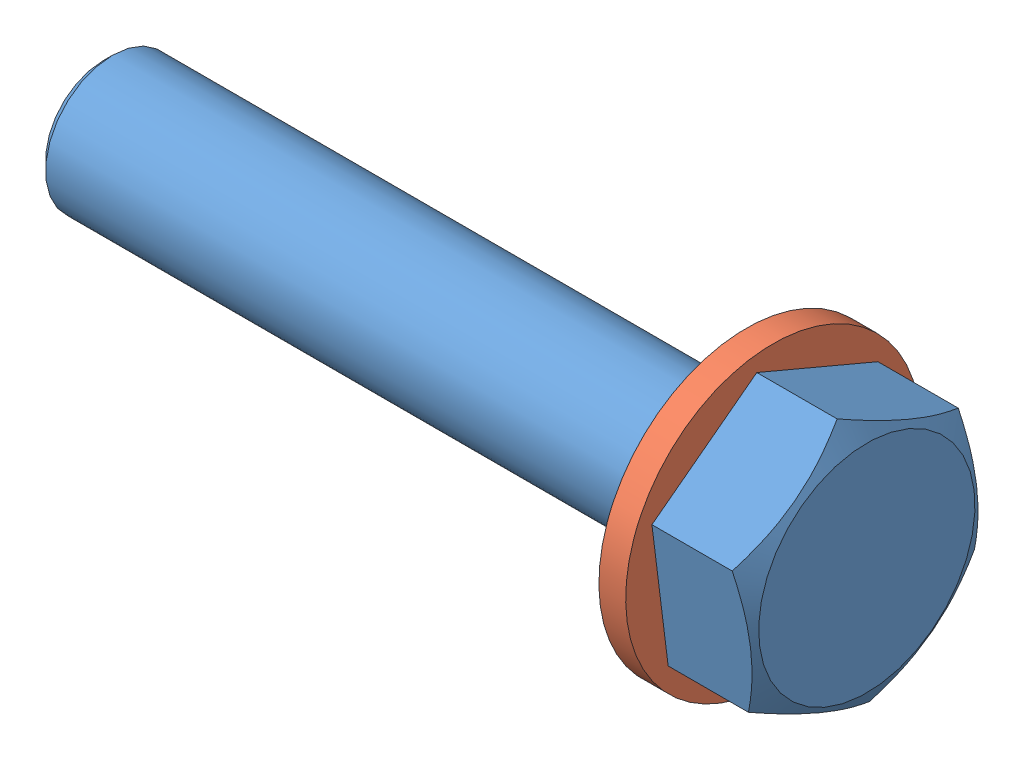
SolidWorks assembly Z-M10 assy.sldasm, configuration M10-50 (file format 10000). Lengths in mm.
2 component instances, 2 part files, 4 mates.
Components (placement in the parent):
- z_Screw_H-1: z_Screw_H.SLDPRT [SCREW H M10x50-26] at (64 -389.5 -18) x (0 -0.123494 0.992345) z (1 0 0)
- z_Washer-1: z_Washer.SLDPRT [WASHER M 10] at (62 -389.5 -18) x (0 0.383049 0.923728) z (1 0 0) size (22 22 2)
Mates (geometry in assembly coordinates):
- Coaxiale7: concentric: cylinder of z_Washer-1 through (66 -467.8961 -18) axis (-1 0 0) radius 5.5; cylinder of z_Screw_H-1 through (41 -467.8961 -18) axis (1 0 0) radius 5
- Coïncidente21: coincident: plane of z_Washer-1 through (64 -389.5 -18) normal (1 0 0); plane of z_Screw_H-1 through (64 -389.5 -18) normal (-1 0 0)
- Coïncidente23: coincident: plane of z_Washer-1 through (64 -389.5 -18) normal (1 0 0); line of z_Screw_H-1 through (64 -395.4196 -10.1711) axis (0 0.992345 0.123494)
- Coaxiale12: concentric anti-aligned: cylinder of z_Washer-1 through (64 -389.5 -18) axis (-1 0 0) radius 5.5; cylinder of z_Screw_H-1 through (14 -389.5 -18) axis (1 0 0) radius 5
